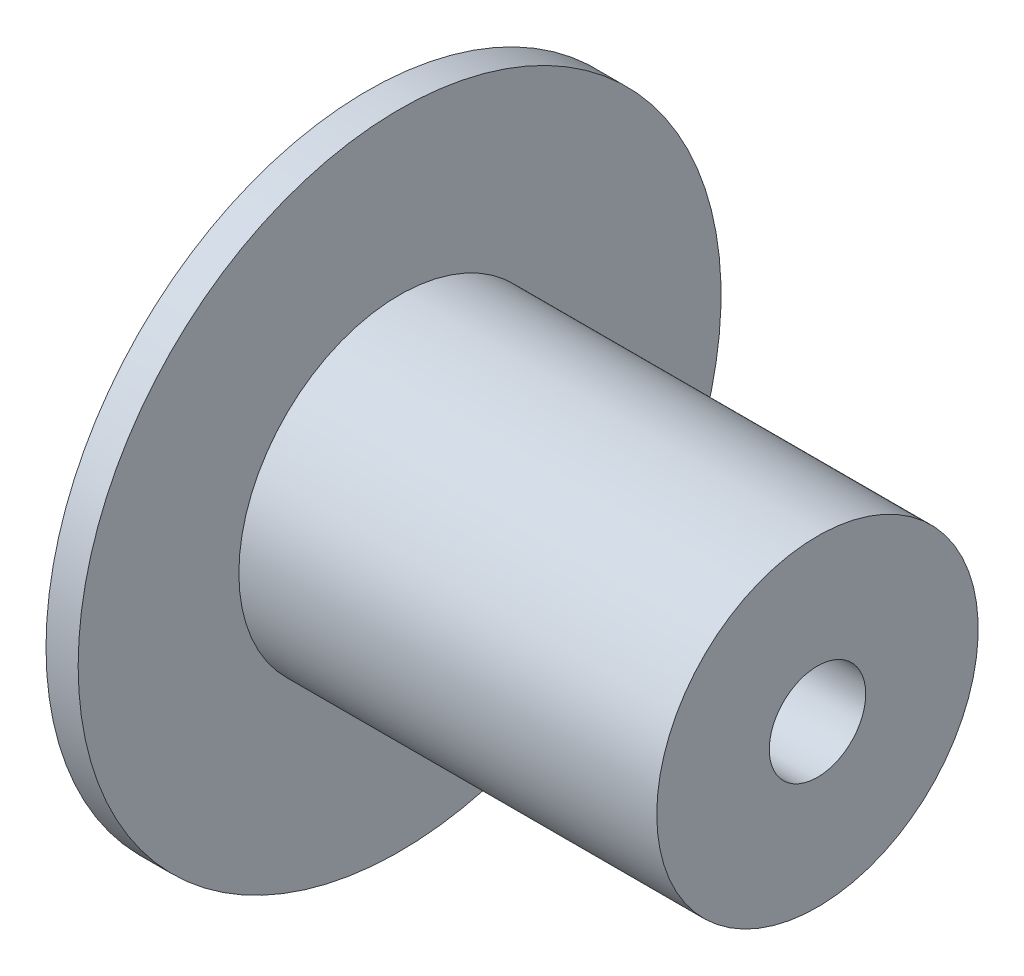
ISO-10303-21;
HEADER;
FILE_DESCRIPTION(('STEP AP214'),'2;1');
FILE_NAME('part.step','',(''),(''),'','','');
FILE_SCHEMA(('AUTOMOTIVE_DESIGN { 1 0 10303 214 1 1 1 1 }'));
ENDSEC;
DATA;
#1=APPLICATION_CONTEXT('core data for automotive mechanical design processes');
#2=APPLICATION_PROTOCOL_DEFINITION('international standard','automotive_design',2000,#1);
#3=PRODUCT_CONTEXT('',#1,'mechanical');
#4=PRODUCT('Part','Part','',(#3));
#5=PRODUCT_RELATED_PRODUCT_CATEGORY('part','',(#4));
#6=PRODUCT_DEFINITION_FORMATION('','',#4);
#7=PRODUCT_DEFINITION_CONTEXT('part definition',#1,'design');
#8=PRODUCT_DEFINITION('design','',#6,#7);
#9=PRODUCT_DEFINITION_SHAPE('','',#8);
#10=(LENGTH_UNIT() NAMED_UNIT(*) SI_UNIT(.MILLI.,.METRE.));
#11=(NAMED_UNIT(*) PLANE_ANGLE_UNIT() SI_UNIT($,.RADIAN.));
#12=(NAMED_UNIT(*) SI_UNIT($,.STERADIAN.) SOLID_ANGLE_UNIT());
#13=UNCERTAINTY_MEASURE_WITH_UNIT(LENGTH_MEASURE(1.E-05),#10,'distance_accuracy_value','');
#14=(GEOMETRIC_REPRESENTATION_CONTEXT(3) GLOBAL_UNCERTAINTY_ASSIGNED_CONTEXT((#13)) GLOBAL_UNIT_ASSIGNED_CONTEXT((#10,
#11,#12)) REPRESENTATION_CONTEXT('',''));
#15=CARTESIAN_POINT('',(0.,0.,0.));
#16=DIRECTION('',(0.,0.,1.));
#17=DIRECTION('',(1.,0.,0.));
#18=AXIS2_PLACEMENT_3D('',#15,#16,#17);
#19=CARTESIAN_POINT('',(0.,0.,0.));
#20=DIRECTION('',(1.,0.,0.));
#21=DIRECTION('',(0.,0.,-1.));
#22=AXIS2_PLACEMENT_3D('',#19,#20,#21);
#23=PLANE('',#22);
#24=CARTESIAN_POINT('',(0.,0.,0.));
#25=DIRECTION('',(-1.,0.,0.));
#26=DIRECTION('',(0.,0.,1.));
#27=AXIS2_PLACEMENT_3D('',#24,#25,#26);
#28=CIRCLE('',#27,10.);
#29=CARTESIAN_POINT('',(0.,0.,10.));
#30=VERTEX_POINT('',#29);
#31=EDGE_CURVE('E10',#30,#30,#28,.T.);
#32=ORIENTED_EDGE('',*,*,#31,.T.);
#33=EDGE_LOOP('',(#32));
#34=FACE_BOUND('',#33,.T.);
#35=ADVANCED_FACE('F30',(#34),#23,.F.);
#36=CARTESIAN_POINT('',(0.,0.,0.));
#37=DIRECTION('',(-1.,0.,0.));
#38=DIRECTION('',(0.,0.,1.));
#39=AXIS2_PLACEMENT_3D('',#36,#37,#38);
#40=CYLINDRICAL_SURFACE('',#39,10.);
#41=ORIENTED_EDGE('',*,*,#31,.F.);
#42=EDGE_LOOP('',(#41));
#43=FACE_BOUND('',#42,.T.);
#44=CARTESIAN_POINT('',(0.999999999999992,0.,0.));
#45=DIRECTION('',(-1.,0.,0.));
#46=DIRECTION('',(0.,0.,1.));
#47=AXIS2_PLACEMENT_3D('',#44,#45,#46);
#48=CIRCLE('',#47,10.);
#49=CARTESIAN_POINT('',(0.999999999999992,0.,10.));
#50=VERTEX_POINT('',#49);
#51=EDGE_CURVE('E36',#50,#50,#48,.T.);
#52=ORIENTED_EDGE('',*,*,#51,.T.);
#53=EDGE_LOOP('',(#52));
#54=FACE_BOUND('',#53,.T.);
#55=ADVANCED_FACE('F78',(#43,#54),#40,.T.);
#56=CARTESIAN_POINT('',(1.,10.,0.));
#57=DIRECTION('',(-1.,0.,0.));
#58=DIRECTION('',(0.,0.,1.));
#59=AXIS2_PLACEMENT_3D('',#56,#57,#58);
#60=PLANE('',#59);
#61=ORIENTED_EDGE('',*,*,#51,.F.);
#62=EDGE_LOOP('',(#61));
#63=FACE_BOUND('',#62,.T.);
#64=CARTESIAN_POINT('',(1.00000000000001,0.,0.));
#65=DIRECTION('',(-1.,0.,0.));
#66=DIRECTION('',(0.,0.,1.));
#67=AXIS2_PLACEMENT_3D('',#64,#65,#66);
#68=CIRCLE('',#67,5.);
#69=CARTESIAN_POINT('',(1.00000000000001,0.,5.));
#70=VERTEX_POINT('',#69);
#71=EDGE_CURVE('E40',#70,#70,#68,.T.);
#72=ORIENTED_EDGE('',*,*,#71,.T.);
#73=EDGE_LOOP('',(#72));
#74=FACE_BOUND('',#73,.T.);
#75=ADVANCED_FACE('F72',(#63,#74),#60,.F.);
#76=CARTESIAN_POINT('',(0.,0.,0.));
#77=DIRECTION('',(-1.,0.,0.));
#78=DIRECTION('',(0.,0.,1.));
#79=AXIS2_PLACEMENT_3D('',#76,#77,#78);
#80=CYLINDRICAL_SURFACE('',#79,5.);
#81=ORIENTED_EDGE('',*,*,#71,.F.);
#82=EDGE_LOOP('',(#81));
#83=FACE_BOUND('',#82,.T.);
#84=CARTESIAN_POINT('',(14.,0.,0.));
#85=DIRECTION('',(-1.,0.,0.));
#86=DIRECTION('',(0.,0.,1.));
#87=AXIS2_PLACEMENT_3D('',#84,#85,#86);
#88=CIRCLE('',#87,5.);
#89=CARTESIAN_POINT('',(14.,0.,5.));
#90=VERTEX_POINT('',#89);
#91=EDGE_CURVE('E44',#90,#90,#88,.T.);
#92=ORIENTED_EDGE('',*,*,#91,.T.);
#93=EDGE_LOOP('',(#92));
#94=FACE_BOUND('',#93,.T.);
#95=ADVANCED_FACE('F67',(#83,#94),#80,.T.);
#96=CARTESIAN_POINT('',(14.,5.,0.));
#97=DIRECTION('',(-1.,0.,0.));
#98=DIRECTION('',(0.,0.,1.));
#99=AXIS2_PLACEMENT_3D('',#96,#97,#98);
#100=PLANE('',#99);
#101=CARTESIAN_POINT('',(14.,0.,0.));
#102=DIRECTION('',(1.,0.,0.));
#103=DIRECTION('',(0.,0.,-1.));
#104=AXIS2_PLACEMENT_3D('',#101,#102,#103);
#105=CIRCLE('',#104,1.5);
#106=CARTESIAN_POINT('',(14.,0.,-1.5));
#107=VERTEX_POINT('',#106);
#108=EDGE_CURVE('E50',#107,#107,#105,.T.);
#109=ORIENTED_EDGE('',*,*,#108,.F.);
#110=EDGE_LOOP('',(#109));
#111=FACE_BOUND('',#110,.T.);
#112=ORIENTED_EDGE('',*,*,#91,.F.);
#113=EDGE_LOOP('',(#112));
#114=FACE_BOUND('',#113,.T.);
#115=ADVANCED_FACE('F61',(#111,#114),#100,.F.);
#116=CARTESIAN_POINT('',(4.00000000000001,0.,0.));
#117=DIRECTION('',(1.,0.,0.));
#118=DIRECTION('',(0.,0.,-1.));
#119=AXIS2_PLACEMENT_3D('',#116,#117,#118);
#120=CYLINDRICAL_SURFACE('',#119,1.5);
#121=CARTESIAN_POINT('',(4.00000000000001,0.,0.));
#122=DIRECTION('',(1.,0.,0.));
#123=DIRECTION('',(0.,0.,-1.));
#124=AXIS2_PLACEMENT_3D('',#121,#122,#123);
#125=CIRCLE('',#124,1.5);
#126=CARTESIAN_POINT('',(4.00000000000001,0.,-1.5));
#127=VERTEX_POINT('',#126);
#128=EDGE_CURVE('E49',#127,#127,#125,.T.);
#129=ORIENTED_EDGE('',*,*,#128,.F.);
#130=EDGE_LOOP('',(#129));
#131=FACE_BOUND('',#130,.T.);
#132=ORIENTED_EDGE('',*,*,#108,.T.);
#133=EDGE_LOOP('',(#132));
#134=FACE_BOUND('',#133,.T.);
#135=ADVANCED_FACE('F58',(#131,#134),#120,.F.);
#136=CARTESIAN_POINT('',(4.00000000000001,0.,0.));
#137=DIRECTION('',(1.,0.,0.));
#138=DIRECTION('',(0.,0.,-1.));
#139=AXIS2_PLACEMENT_3D('',#136,#137,#138);
#140=PLANE('',#139);
#141=ORIENTED_EDGE('',*,*,#128,.T.);
#142=EDGE_LOOP('',(#141));
#143=FACE_BOUND('',#142,.T.);
#144=ADVANCED_FACE('F56',(#143),#140,.T.);
#145=CLOSED_SHELL('',(#35,#55,#75,#95,#115,#135,#144));
#146=MANIFOLD_SOLID_BREP('B2',#145);
#147=ADVANCED_BREP_SHAPE_REPRESENTATION('',(#18,#146),#14);
#148=SHAPE_DEFINITION_REPRESENTATION(#9,#147);
ENDSEC;
END-ISO-10303-21;
